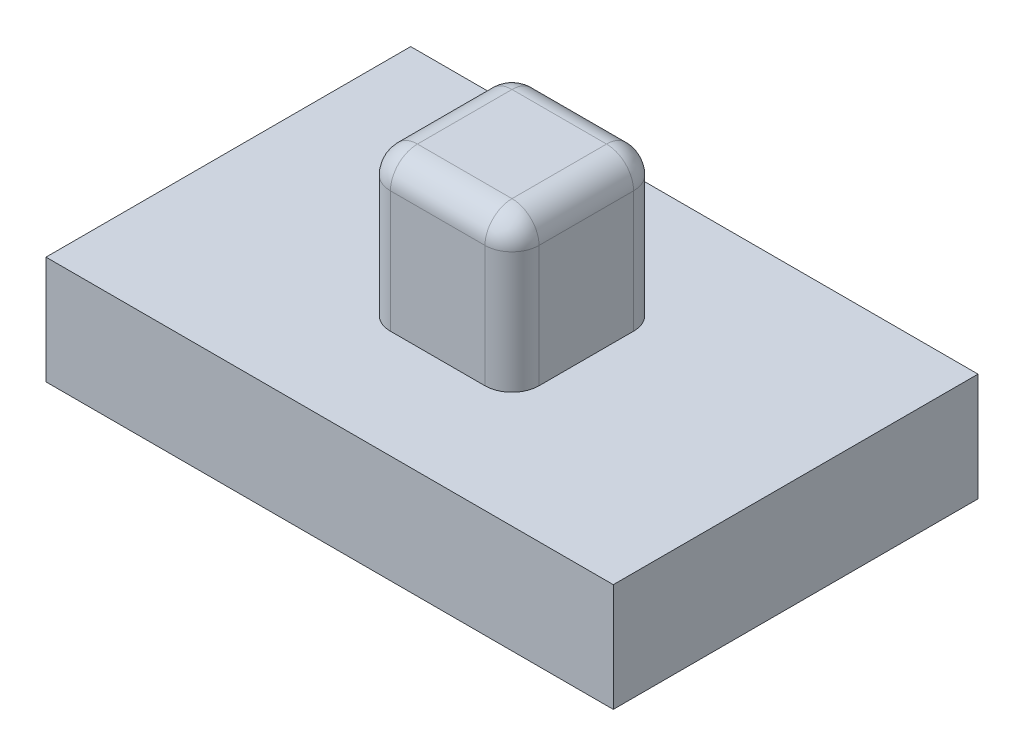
ISO-10303-21;
HEADER;
FILE_DESCRIPTION(('STEP AP214'),'2;1');
FILE_NAME('part.step','',(''),(''),'','','');
FILE_SCHEMA(('AUTOMOTIVE_DESIGN { 1 0 10303 214 1 1 1 1 }'));
ENDSEC;
DATA;
#1=APPLICATION_CONTEXT('core data for automotive mechanical design processes');
#2=APPLICATION_PROTOCOL_DEFINITION('international standard','automotive_design',2000,#1);
#3=PRODUCT_CONTEXT('',#1,'mechanical');
#4=PRODUCT('Part','Part','',(#3));
#5=PRODUCT_RELATED_PRODUCT_CATEGORY('part','',(#4));
#6=PRODUCT_DEFINITION_FORMATION('','',#4);
#7=PRODUCT_DEFINITION_CONTEXT('part definition',#1,'design');
#8=PRODUCT_DEFINITION('design','',#6,#7);
#9=PRODUCT_DEFINITION_SHAPE('','',#8);
#10=(LENGTH_UNIT() NAMED_UNIT(*) SI_UNIT(.MILLI.,.METRE.));
#11=(NAMED_UNIT(*) PLANE_ANGLE_UNIT() SI_UNIT($,.RADIAN.));
#12=(NAMED_UNIT(*) SI_UNIT($,.STERADIAN.) SOLID_ANGLE_UNIT());
#13=UNCERTAINTY_MEASURE_WITH_UNIT(LENGTH_MEASURE(1.E-05),#10,'distance_accuracy_value','');
#14=(GEOMETRIC_REPRESENTATION_CONTEXT(3) GLOBAL_UNCERTAINTY_ASSIGNED_CONTEXT((#13)) GLOBAL_UNIT_ASSIGNED_CONTEXT((#10,
#11,#12)) REPRESENTATION_CONTEXT('',''));
#15=CARTESIAN_POINT('',(0.,0.,0.));
#16=DIRECTION('',(0.,0.,1.));
#17=DIRECTION('',(1.,0.,0.));
#18=AXIS2_PLACEMENT_3D('',#15,#16,#17);
#19=CARTESIAN_POINT('',(0.,8.,0.));
#20=DIRECTION('',(0.,-1.,0.));
#21=DIRECTION('',(0.,0.,-1.));
#22=AXIS2_PLACEMENT_3D('',#19,#20,#21);
#23=PLANE('',#22);
#24=DIRECTION('',(0.,0.,-1.));
#25=VECTOR('',#24,1.);
#26=CARTESIAN_POINT('',(21.,8.,13.5));
#27=LINE('',#26,#25);
#28=CARTESIAN_POINT('',(21.,8.,13.5));
#29=VERTEX_POINT('',#28);
#30=CARTESIAN_POINT('',(21.,8.,-13.5));
#31=VERTEX_POINT('',#30);
#32=EDGE_CURVE('E147',#29,#31,#27,.T.);
#33=ORIENTED_EDGE('',*,*,#32,.T.);
#34=DIRECTION('',(-1.,0.,0.));
#35=VECTOR('',#34,1.);
#36=CARTESIAN_POINT('',(-21.,8.,-13.5));
#37=LINE('',#36,#35);
#38=CARTESIAN_POINT('',(-21.,8.,-13.5));
#39=VERTEX_POINT('',#38);
#40=EDGE_CURVE('E136',#31,#39,#37,.T.);
#41=ORIENTED_EDGE('',*,*,#40,.T.);
#42=DIRECTION('',(0.,0.,1.));
#43=VECTOR('',#42,1.);
#44=CARTESIAN_POINT('',(-21.,8.,13.5));
#45=LINE('',#44,#43);
#46=CARTESIAN_POINT('',(-21.,8.,13.5));
#47=VERTEX_POINT('',#46);
#48=EDGE_CURVE('E146',#39,#47,#45,.T.);
#49=ORIENTED_EDGE('',*,*,#48,.T.);
#50=DIRECTION('',(1.,0.,0.));
#51=VECTOR('',#50,1.);
#52=CARTESIAN_POINT('',(-21.,8.,13.5));
#53=LINE('',#52,#51);
#54=EDGE_CURVE('E152',#47,#29,#53,.T.);
#55=ORIENTED_EDGE('',*,*,#54,.T.);
#56=EDGE_LOOP('',(#33,#41,#49,#55));
#57=FACE_BOUND('',#56,.T.);
#58=DIRECTION('',(0.,0.,-1.));
#59=VECTOR('',#58,1.);
#60=CARTESIAN_POINT('',(5.5,8.,5.5));
#61=LINE('',#60,#59);
#62=CARTESIAN_POINT('',(5.5,8.,3.5));
#63=VERTEX_POINT('',#62);
#64=CARTESIAN_POINT('',(5.5,8.,-3.5));
#65=VERTEX_POINT('',#64);
#66=EDGE_CURVE('E236',#63,#65,#61,.T.);
#67=ORIENTED_EDGE('',*,*,#66,.F.);
#68=CARTESIAN_POINT('',(3.5,8.,3.5));
#69=DIRECTION('',(0.,-1.,0.));
#70=DIRECTION('',(0.,0.,-1.));
#71=AXIS2_PLACEMENT_3D('',#68,#69,#70);
#72=CIRCLE('',#71,2.);
#73=CARTESIAN_POINT('',(3.5,8.,5.5));
#74=VERTEX_POINT('',#73);
#75=EDGE_CURVE('E11',#63,#74,#72,.T.);
#76=ORIENTED_EDGE('',*,*,#75,.T.);
#77=DIRECTION('',(1.,0.,0.));
#78=VECTOR('',#77,1.);
#79=CARTESIAN_POINT('',(-5.5,8.,5.5));
#80=LINE('',#79,#78);
#81=CARTESIAN_POINT('',(-3.5,8.,5.5));
#82=VERTEX_POINT('',#81);
#83=EDGE_CURVE('E247',#82,#74,#80,.T.);
#84=ORIENTED_EDGE('',*,*,#83,.F.);
#85=CARTESIAN_POINT('',(-3.5,8.,3.5));
#86=DIRECTION('',(0.,-1.,0.));
#87=DIRECTION('',(0.,0.,-1.));
#88=AXIS2_PLACEMENT_3D('',#85,#86,#87);
#89=CIRCLE('',#88,2.);
#90=CARTESIAN_POINT('',(-5.5,8.,3.5));
#91=VERTEX_POINT('',#90);
#92=EDGE_CURVE('E43',#82,#91,#89,.T.);
#93=ORIENTED_EDGE('',*,*,#92,.T.);
#94=DIRECTION('',(0.,0.,1.));
#95=VECTOR('',#94,1.);
#96=CARTESIAN_POINT('',(-5.5,8.,5.5));
#97=LINE('',#96,#95);
#98=CARTESIAN_POINT('',(-5.5,8.,-3.5));
#99=VERTEX_POINT('',#98);
#100=EDGE_CURVE('E242',#99,#91,#97,.T.);
#101=ORIENTED_EDGE('',*,*,#100,.F.);
#102=CARTESIAN_POINT('',(-3.5,8.,-3.5));
#103=DIRECTION('',(0.,-1.,0.));
#104=DIRECTION('',(0.,0.,-1.));
#105=AXIS2_PLACEMENT_3D('',#102,#103,#104);
#106=CIRCLE('',#105,2.);
#107=CARTESIAN_POINT('',(-3.5,8.,-5.5));
#108=VERTEX_POINT('',#107);
#109=EDGE_CURVE('E200',#99,#108,#106,.T.);
#110=ORIENTED_EDGE('',*,*,#109,.T.);
#111=DIRECTION('',(-1.,0.,0.));
#112=VECTOR('',#111,1.);
#113=CARTESIAN_POINT('',(-5.5,8.,-5.5));
#114=LINE('',#113,#112);
#115=CARTESIAN_POINT('',(3.5,8.,-5.5));
#116=VERTEX_POINT('',#115);
#117=EDGE_CURVE('E238',#116,#108,#114,.T.);
#118=ORIENTED_EDGE('',*,*,#117,.F.);
#119=CARTESIAN_POINT('',(3.5,8.,-3.5));
#120=DIRECTION('',(0.,-1.,0.));
#121=DIRECTION('',(0.,0.,-1.));
#122=AXIS2_PLACEMENT_3D('',#119,#120,#121);
#123=CIRCLE('',#122,2.);
#124=EDGE_CURVE('E198',#116,#65,#123,.T.);
#125=ORIENTED_EDGE('',*,*,#124,.T.);
#126=EDGE_LOOP('',(#67,#76,#84,#93,#101,#110,#118,#125));
#127=FACE_BOUND('',#126,.T.);
#128=ADVANCED_FACE('F34',(#57,#127),#23,.F.);
#129=CARTESIAN_POINT('',(21.,8.,13.5));
#130=DIRECTION('',(-1.,0.,0.));
#131=DIRECTION('',(0.,0.,1.));
#132=AXIS2_PLACEMENT_3D('',#129,#130,#131);
#133=PLANE('',#132);
#134=DIRECTION('',(0.,0.,-1.));
#135=VECTOR('',#134,1.);
#136=CARTESIAN_POINT('',(21.,0.,13.5));
#137=LINE('',#136,#135);
#138=CARTESIAN_POINT('',(21.,0.,13.5));
#139=VERTEX_POINT('',#138);
#140=CARTESIAN_POINT('',(21.,0.,-13.5));
#141=VERTEX_POINT('',#140);
#142=EDGE_CURVE('E160',#139,#141,#137,.T.);
#143=ORIENTED_EDGE('',*,*,#142,.T.);
#144=DIRECTION('',(0.,-1.,0.));
#145=VECTOR('',#144,1.);
#146=CARTESIAN_POINT('',(21.,8.,-13.5));
#147=LINE('',#146,#145);
#148=EDGE_CURVE('E140',#31,#141,#147,.T.);
#149=ORIENTED_EDGE('',*,*,#148,.F.);
#150=ORIENTED_EDGE('',*,*,#32,.F.);
#151=DIRECTION('',(0.,-1.,0.));
#152=VECTOR('',#151,1.);
#153=CARTESIAN_POINT('',(21.,8.,13.5));
#154=LINE('',#153,#152);
#155=EDGE_CURVE('E252',#29,#139,#154,.T.);
#156=ORIENTED_EDGE('',*,*,#155,.T.);
#157=EDGE_LOOP('',(#143,#149,#150,#156));
#158=FACE_BOUND('',#157,.T.);
#159=ADVANCED_FACE('F158',(#158),#133,.F.);
#160=CARTESIAN_POINT('',(-21.,8.,-13.5));
#161=DIRECTION('',(0.,0.,1.));
#162=DIRECTION('',(1.,0.,0.));
#163=AXIS2_PLACEMENT_3D('',#160,#161,#162);
#164=PLANE('',#163);
#165=DIRECTION('',(-1.,0.,0.));
#166=VECTOR('',#165,1.);
#167=CARTESIAN_POINT('',(-21.,0.,-13.5));
#168=LINE('',#167,#166);
#169=CARTESIAN_POINT('',(-21.,0.,-13.5));
#170=VERTEX_POINT('',#169);
#171=EDGE_CURVE('E254',#141,#170,#168,.T.);
#172=ORIENTED_EDGE('',*,*,#171,.T.);
#173=DIRECTION('',(0.,-1.,0.));
#174=VECTOR('',#173,1.);
#175=CARTESIAN_POINT('',(-21.,8.,-13.5));
#176=LINE('',#175,#174);
#177=EDGE_CURVE('E143',#39,#170,#176,.T.);
#178=ORIENTED_EDGE('',*,*,#177,.F.);
#179=ORIENTED_EDGE('',*,*,#40,.F.);
#180=ORIENTED_EDGE('',*,*,#148,.T.);
#181=EDGE_LOOP('',(#172,#178,#179,#180));
#182=FACE_BOUND('',#181,.T.);
#183=ADVANCED_FACE('F138',(#182),#164,.F.);
#184=CARTESIAN_POINT('',(-21.,8.,13.5));
#185=DIRECTION('',(1.,0.,0.));
#186=DIRECTION('',(0.,0.,-1.));
#187=AXIS2_PLACEMENT_3D('',#184,#185,#186);
#188=PLANE('',#187);
#189=DIRECTION('',(0.,0.,1.));
#190=VECTOR('',#189,1.);
#191=CARTESIAN_POINT('',(-21.,0.,13.5));
#192=LINE('',#191,#190);
#193=CARTESIAN_POINT('',(-21.,0.,13.5));
#194=VERTEX_POINT('',#193);
#195=EDGE_CURVE('E256',#170,#194,#192,.T.);
#196=ORIENTED_EDGE('',*,*,#195,.T.);
#197=DIRECTION('',(0.,-1.,0.));
#198=VECTOR('',#197,1.);
#199=CARTESIAN_POINT('',(-21.,8.,13.5));
#200=LINE('',#199,#198);
#201=EDGE_CURVE('E165',#47,#194,#200,.T.);
#202=ORIENTED_EDGE('',*,*,#201,.F.);
#203=ORIENTED_EDGE('',*,*,#48,.F.);
#204=ORIENTED_EDGE('',*,*,#177,.T.);
#205=EDGE_LOOP('',(#196,#202,#203,#204));
#206=FACE_BOUND('',#205,.T.);
#207=ADVANCED_FACE('F268',(#206),#188,.F.);
#208=CARTESIAN_POINT('',(-21.,8.,13.5));
#209=DIRECTION('',(0.,0.,-1.));
#210=DIRECTION('',(-1.,0.,0.));
#211=AXIS2_PLACEMENT_3D('',#208,#209,#210);
#212=PLANE('',#211);
#213=DIRECTION('',(1.,0.,0.));
#214=VECTOR('',#213,1.);
#215=CARTESIAN_POINT('',(-21.,0.,13.5));
#216=LINE('',#215,#214);
#217=EDGE_CURVE('E156',#194,#139,#216,.T.);
#218=ORIENTED_EDGE('',*,*,#217,.T.);
#219=ORIENTED_EDGE('',*,*,#155,.F.);
#220=ORIENTED_EDGE('',*,*,#54,.F.);
#221=ORIENTED_EDGE('',*,*,#201,.T.);
#222=EDGE_LOOP('',(#218,#219,#220,#221));
#223=FACE_BOUND('',#222,.T.);
#224=ADVANCED_FACE('F263',(#223),#212,.F.);
#225=CARTESIAN_POINT('',(0.,0.,0.));
#226=DIRECTION('',(0.,-1.,0.));
#227=DIRECTION('',(0.,0.,-1.));
#228=AXIS2_PLACEMENT_3D('',#225,#226,#227);
#229=PLANE('',#228);
#230=ORIENTED_EDGE('',*,*,#142,.F.);
#231=ORIENTED_EDGE('',*,*,#217,.F.);
#232=ORIENTED_EDGE('',*,*,#195,.F.);
#233=ORIENTED_EDGE('',*,*,#171,.F.);
#234=EDGE_LOOP('',(#230,#231,#232,#233));
#235=FACE_BOUND('',#234,.T.);
#236=ADVANCED_FACE('F267',(#235),#229,.T.);
#237=CARTESIAN_POINT('',(5.5,19.,5.5));
#238=DIRECTION('',(-1.,0.,0.));
#239=DIRECTION('',(0.,0.,1.));
#240=AXIS2_PLACEMENT_3D('',#237,#238,#239);
#241=PLANE('',#240);
#242=ORIENTED_EDGE('',*,*,#66,.T.);
#243=DIRECTION('',(0.,-1.,0.));
#244=VECTOR('',#243,1.);
#245=CARTESIAN_POINT('',(5.5,19.,-3.5));
#246=LINE('',#245,#244);
#247=CARTESIAN_POINT('',(5.5,17.,-3.5));
#248=VERTEX_POINT('',#247);
#249=EDGE_CURVE('E51',#65,#248,#246,.F.);
#250=ORIENTED_EDGE('',*,*,#249,.T.);
#251=DIRECTION('',(0.,0.,-1.));
#252=VECTOR('',#251,1.);
#253=CARTESIAN_POINT('',(5.5,17.,5.5));
#254=LINE('',#253,#252);
#255=CARTESIAN_POINT('',(5.5,17.,3.5));
#256=VERTEX_POINT('',#255);
#257=EDGE_CURVE('E56',#248,#256,#254,.F.);
#258=ORIENTED_EDGE('',*,*,#257,.T.);
#259=DIRECTION('',(0.,-1.,0.));
#260=VECTOR('',#259,1.);
#261=CARTESIAN_POINT('',(5.5,19.,3.5));
#262=LINE('',#261,#260);
#263=EDGE_CURVE('E194',#256,#63,#262,.T.);
#264=ORIENTED_EDGE('',*,*,#263,.T.);
#265=EDGE_LOOP('',(#242,#250,#258,#264));
#266=FACE_BOUND('',#265,.T.);
#267=ADVANCED_FACE('F285',(#266),#241,.F.);
#268=CARTESIAN_POINT('',(-5.5,19.,-5.5));
#269=DIRECTION('',(0.,0.,1.));
#270=DIRECTION('',(1.,0.,0.));
#271=AXIS2_PLACEMENT_3D('',#268,#269,#270);
#272=PLANE('',#271);
#273=DIRECTION('',(-1.,0.,0.));
#274=VECTOR('',#273,1.);
#275=CARTESIAN_POINT('',(-5.5,17.,-5.5));
#276=LINE('',#275,#274);
#277=CARTESIAN_POINT('',(-3.5,17.,-5.5));
#278=VERTEX_POINT('',#277);
#279=CARTESIAN_POINT('',(3.5,17.,-5.5));
#280=VERTEX_POINT('',#279);
#281=EDGE_CURVE('E190',#278,#280,#276,.F.);
#282=ORIENTED_EDGE('',*,*,#281,.T.);
#283=DIRECTION('',(0.,-1.,0.));
#284=VECTOR('',#283,1.);
#285=CARTESIAN_POINT('',(3.5,19.,-5.5));
#286=LINE('',#285,#284);
#287=EDGE_CURVE('E192',#280,#116,#286,.T.);
#288=ORIENTED_EDGE('',*,*,#287,.T.);
#289=ORIENTED_EDGE('',*,*,#117,.T.);
#290=DIRECTION('',(0.,-1.,0.));
#291=VECTOR('',#290,1.);
#292=CARTESIAN_POINT('',(-3.5,19.,-5.5));
#293=LINE('',#292,#291);
#294=EDGE_CURVE('E188',#108,#278,#293,.F.);
#295=ORIENTED_EDGE('',*,*,#294,.T.);
#296=EDGE_LOOP('',(#282,#288,#289,#295));
#297=FACE_BOUND('',#296,.T.);
#298=ADVANCED_FACE('F291',(#297),#272,.F.);
#299=CARTESIAN_POINT('',(-5.5,19.,5.5));
#300=DIRECTION('',(1.,0.,0.));
#301=DIRECTION('',(0.,0.,-1.));
#302=AXIS2_PLACEMENT_3D('',#299,#300,#301);
#303=PLANE('',#302);
#304=DIRECTION('',(0.,0.,1.));
#305=VECTOR('',#304,1.);
#306=CARTESIAN_POINT('',(-5.5,17.,5.5));
#307=LINE('',#306,#305);
#308=CARTESIAN_POINT('',(-5.5,17.,3.5));
#309=VERTEX_POINT('',#308);
#310=CARTESIAN_POINT('',(-5.5,17.,-3.5));
#311=VERTEX_POINT('',#310);
#312=EDGE_CURVE('E184',#309,#311,#307,.F.);
#313=ORIENTED_EDGE('',*,*,#312,.T.);
#314=DIRECTION('',(0.,-1.,0.));
#315=VECTOR('',#314,1.);
#316=CARTESIAN_POINT('',(-5.5,19.,-3.5));
#317=LINE('',#316,#315);
#318=EDGE_CURVE('E186',#311,#99,#317,.T.);
#319=ORIENTED_EDGE('',*,*,#318,.T.);
#320=ORIENTED_EDGE('',*,*,#100,.T.);
#321=DIRECTION('',(0.,-1.,0.));
#322=VECTOR('',#321,1.);
#323=CARTESIAN_POINT('',(-5.5,19.,3.5));
#324=LINE('',#323,#322);
#325=EDGE_CURVE('E182',#91,#309,#324,.F.);
#326=ORIENTED_EDGE('',*,*,#325,.T.);
#327=EDGE_LOOP('',(#313,#319,#320,#326));
#328=FACE_BOUND('',#327,.T.);
#329=ADVANCED_FACE('F295',(#328),#303,.F.);
#330=CARTESIAN_POINT('',(-5.5,19.,5.5));
#331=DIRECTION('',(0.,0.,-1.));
#332=DIRECTION('',(-1.,0.,0.));
#333=AXIS2_PLACEMENT_3D('',#330,#331,#332);
#334=PLANE('',#333);
#335=DIRECTION('',(1.,0.,0.));
#336=VECTOR('',#335,1.);
#337=CARTESIAN_POINT('',(-5.5,17.,5.5));
#338=LINE('',#337,#336);
#339=CARTESIAN_POINT('',(3.5,17.,5.5));
#340=VERTEX_POINT('',#339);
#341=CARTESIAN_POINT('',(-3.5,17.,5.5));
#342=VERTEX_POINT('',#341);
#343=EDGE_CURVE('E177',#340,#342,#338,.F.);
#344=ORIENTED_EDGE('',*,*,#343,.T.);
#345=DIRECTION('',(0.,-1.,0.));
#346=VECTOR('',#345,1.);
#347=CARTESIAN_POINT('',(-3.5,19.,5.5));
#348=LINE('',#347,#346);
#349=EDGE_CURVE('E180',#342,#82,#348,.T.);
#350=ORIENTED_EDGE('',*,*,#349,.T.);
#351=ORIENTED_EDGE('',*,*,#83,.T.);
#352=DIRECTION('',(0.,-1.,0.));
#353=VECTOR('',#352,1.);
#354=CARTESIAN_POINT('',(3.5,19.,5.5));
#355=LINE('',#354,#353);
#356=EDGE_CURVE('E175',#74,#340,#355,.F.);
#357=ORIENTED_EDGE('',*,*,#356,.T.);
#358=EDGE_LOOP('',(#344,#350,#351,#357));
#359=FACE_BOUND('',#358,.T.);
#360=ADVANCED_FACE('F300',(#359),#334,.F.);
#361=CARTESIAN_POINT('',(0.,19.,0.));
#362=DIRECTION('',(0.,-1.,0.));
#363=DIRECTION('',(0.,0.,-1.));
#364=AXIS2_PLACEMENT_3D('',#361,#362,#363);
#365=PLANE('',#364);
#366=DIRECTION('',(0.,0.,1.));
#367=VECTOR('',#366,1.);
#368=CARTESIAN_POINT('',(-3.5,19.,0.));
#369=LINE('',#368,#367);
#370=CARTESIAN_POINT('',(-3.5,19.,-3.5));
#371=VERTEX_POINT('',#370);
#372=CARTESIAN_POINT('',(-3.5,19.,3.5));
#373=VERTEX_POINT('',#372);
#374=EDGE_CURVE('E170',#371,#373,#369,.T.);
#375=ORIENTED_EDGE('',*,*,#374,.T.);
#376=DIRECTION('',(1.,0.,0.));
#377=VECTOR('',#376,1.);
#378=CARTESIAN_POINT('',(0.,19.,3.5));
#379=LINE('',#378,#377);
#380=CARTESIAN_POINT('',(3.5,19.,3.5));
#381=VERTEX_POINT('',#380);
#382=EDGE_CURVE('E172',#373,#381,#379,.T.);
#383=ORIENTED_EDGE('',*,*,#382,.T.);
#384=DIRECTION('',(0.,0.,-1.));
#385=VECTOR('',#384,1.);
#386=CARTESIAN_POINT('',(3.5,19.,0.));
#387=LINE('',#386,#385);
#388=CARTESIAN_POINT('',(3.5,19.,-3.5));
#389=VERTEX_POINT('',#388);
#390=EDGE_CURVE('E161',#381,#389,#387,.T.);
#391=ORIENTED_EDGE('',*,*,#390,.T.);
#392=DIRECTION('',(-1.,0.,0.));
#393=VECTOR('',#392,1.);
#394=CARTESIAN_POINT('',(0.,19.,-3.5));
#395=LINE('',#394,#393);
#396=EDGE_CURVE('E163',#389,#371,#395,.T.);
#397=ORIENTED_EDGE('',*,*,#396,.T.);
#398=EDGE_LOOP('',(#375,#383,#391,#397));
#399=FACE_BOUND('',#398,.T.);
#400=ADVANCED_FACE('F306',(#399),#365,.F.);
#401=CARTESIAN_POINT('',(-3.5,19.,-3.5));
#402=DIRECTION('',(0.,-1.,0.));
#403=DIRECTION('',(0.,0.,-1.));
#404=AXIS2_PLACEMENT_3D('',#401,#402,#403);
#405=CYLINDRICAL_SURFACE('',#404,2.);
#406=ORIENTED_EDGE('',*,*,#109,.F.);
#407=ORIENTED_EDGE('',*,*,#318,.F.);
#408=CARTESIAN_POINT('',(-3.5,17.,-3.5));
#409=DIRECTION('',(0.,1.,0.));
#410=DIRECTION('',(0.,0.,1.));
#411=AXIS2_PLACEMENT_3D('',#408,#409,#410);
#412=CIRCLE('',#411,2.);
#413=EDGE_CURVE('E38',#278,#311,#412,.T.);
#414=ORIENTED_EDGE('',*,*,#413,.F.);
#415=ORIENTED_EDGE('',*,*,#294,.F.);
#416=EDGE_LOOP('',(#406,#407,#414,#415));
#417=FACE_BOUND('',#416,.T.);
#418=ADVANCED_FACE('F36',(#417),#405,.T.);
#419=CARTESIAN_POINT('',(0.,17.,-3.5));
#420=DIRECTION('',(-1.,0.,0.));
#421=DIRECTION('',(0.,0.,1.));
#422=AXIS2_PLACEMENT_3D('',#419,#420,#421);
#423=CYLINDRICAL_SURFACE('',#422,2.);
#424=CARTESIAN_POINT('',(3.5,17.,-3.5));
#425=DIRECTION('',(1.,0.,0.));
#426=DIRECTION('',(0.,0.,-1.));
#427=AXIS2_PLACEMENT_3D('',#424,#425,#426);
#428=CIRCLE('',#427,2.);
#429=EDGE_CURVE('E228',#280,#389,#428,.T.);
#430=ORIENTED_EDGE('',*,*,#429,.F.);
#431=ORIENTED_EDGE('',*,*,#281,.F.);
#432=CARTESIAN_POINT('',(-3.5,17.,-3.5));
#433=DIRECTION('',(-1.,0.,0.));
#434=DIRECTION('',(0.,0.,1.));
#435=AXIS2_PLACEMENT_3D('',#432,#433,#434);
#436=CIRCLE('',#435,2.);
#437=EDGE_CURVE('E230',#371,#278,#436,.T.);
#438=ORIENTED_EDGE('',*,*,#437,.F.);
#439=ORIENTED_EDGE('',*,*,#396,.F.);
#440=EDGE_LOOP('',(#430,#431,#438,#439));
#441=FACE_BOUND('',#440,.T.);
#442=ADVANCED_FACE('F313',(#441),#423,.T.);
#443=CARTESIAN_POINT('',(3.5,19.,-3.5));
#444=DIRECTION('',(0.,-1.,0.));
#445=DIRECTION('',(0.,0.,-1.));
#446=AXIS2_PLACEMENT_3D('',#443,#444,#445);
#447=CYLINDRICAL_SURFACE('',#446,2.);
#448=ORIENTED_EDGE('',*,*,#124,.F.);
#449=ORIENTED_EDGE('',*,*,#287,.F.);
#450=CARTESIAN_POINT('',(3.5,17.,-3.5));
#451=DIRECTION('',(0.,1.,0.));
#452=DIRECTION('',(0.,0.,1.));
#453=AXIS2_PLACEMENT_3D('',#450,#451,#452);
#454=CIRCLE('',#453,2.);
#455=EDGE_CURVE('E225',#248,#280,#454,.T.);
#456=ORIENTED_EDGE('',*,*,#455,.F.);
#457=ORIENTED_EDGE('',*,*,#249,.F.);
#458=EDGE_LOOP('',(#448,#449,#456,#457));
#459=FACE_BOUND('',#458,.T.);
#460=ADVANCED_FACE('F347',(#459),#447,.T.);
#461=CARTESIAN_POINT('',(-3.5,17.,-3.5));
#462=DIRECTION('',(0.,0.,1.));
#463=DIRECTION('',(1.,0.,0.));
#464=AXIS2_PLACEMENT_3D('',#461,#462,#463);
#465=SPHERICAL_SURFACE('',#464,2.);
#466=ORIENTED_EDGE('',*,*,#437,.T.);
#467=ORIENTED_EDGE('',*,*,#413,.T.);
#468=CARTESIAN_POINT('',(-3.5,17.,-3.5));
#469=DIRECTION('',(0.,0.,-1.));
#470=DIRECTION('',(0.,1.,0.));
#471=AXIS2_PLACEMENT_3D('',#468,#469,#470);
#472=CIRCLE('',#471,2.);
#473=EDGE_CURVE('E222',#371,#311,#472,.F.);
#474=ORIENTED_EDGE('',*,*,#473,.F.);
#475=EDGE_LOOP('',(#466,#467,#474));
#476=FACE_BOUND('',#475,.T.);
#477=ADVANCED_FACE('F378',(#476),#465,.T.);
#478=CARTESIAN_POINT('',(3.5,17.,-3.5));
#479=DIRECTION('',(0.,0.,1.));
#480=DIRECTION('',(1.,0.,0.));
#481=AXIS2_PLACEMENT_3D('',#478,#479,#480);
#482=SPHERICAL_SURFACE('',#481,2.);
#483=ORIENTED_EDGE('',*,*,#455,.T.);
#484=ORIENTED_EDGE('',*,*,#429,.T.);
#485=CARTESIAN_POINT('',(3.5,17.,-3.5));
#486=DIRECTION('',(0.,0.,-1.));
#487=DIRECTION('',(-1.,0.,0.));
#488=AXIS2_PLACEMENT_3D('',#485,#486,#487);
#489=CIRCLE('',#488,2.);
#490=EDGE_CURVE('E219',#248,#389,#489,.F.);
#491=ORIENTED_EDGE('',*,*,#490,.F.);
#492=EDGE_LOOP('',(#483,#484,#491));
#493=FACE_BOUND('',#492,.T.);
#494=ADVANCED_FACE('F343',(#493),#482,.T.);
#495=CARTESIAN_POINT('',(-3.5,19.,3.5));
#496=DIRECTION('',(0.,-1.,0.));
#497=DIRECTION('',(0.,0.,-1.));
#498=AXIS2_PLACEMENT_3D('',#495,#496,#497);
#499=CYLINDRICAL_SURFACE('',#498,2.);
#500=ORIENTED_EDGE('',*,*,#92,.F.);
#501=ORIENTED_EDGE('',*,*,#349,.F.);
#502=CARTESIAN_POINT('',(-3.5,17.,3.5));
#503=DIRECTION('',(0.,1.,0.));
#504=DIRECTION('',(0.,0.,1.));
#505=AXIS2_PLACEMENT_3D('',#502,#503,#504);
#506=CIRCLE('',#505,2.);
#507=EDGE_CURVE('E216',#309,#342,#506,.T.);
#508=ORIENTED_EDGE('',*,*,#507,.F.);
#509=ORIENTED_EDGE('',*,*,#325,.F.);
#510=EDGE_LOOP('',(#500,#501,#508,#509));
#511=FACE_BOUND('',#510,.T.);
#512=ADVANCED_FACE('F356',(#511),#499,.T.);
#513=CARTESIAN_POINT('',(-3.5,17.,0.));
#514=DIRECTION('',(0.,0.,1.));
#515=DIRECTION('',(1.,0.,0.));
#516=AXIS2_PLACEMENT_3D('',#513,#514,#515);
#517=CYLINDRICAL_SURFACE('',#516,2.);
#518=ORIENTED_EDGE('',*,*,#473,.T.);
#519=ORIENTED_EDGE('',*,*,#312,.F.);
#520=CARTESIAN_POINT('',(-3.5,17.,3.5));
#521=DIRECTION('',(0.,0.,1.));
#522=DIRECTION('',(1.,0.,0.));
#523=AXIS2_PLACEMENT_3D('',#520,#521,#522);
#524=CIRCLE('',#523,2.);
#525=EDGE_CURVE('E213',#373,#309,#524,.T.);
#526=ORIENTED_EDGE('',*,*,#525,.F.);
#527=ORIENTED_EDGE('',*,*,#374,.F.);
#528=EDGE_LOOP('',(#518,#519,#526,#527));
#529=FACE_BOUND('',#528,.T.);
#530=ADVANCED_FACE('F322',(#529),#517,.T.);
#531=CARTESIAN_POINT('',(3.5,17.,0.));
#532=DIRECTION('',(0.,0.,-1.));
#533=DIRECTION('',(-1.,0.,0.));
#534=AXIS2_PLACEMENT_3D('',#531,#532,#533);
#535=CYLINDRICAL_SURFACE('',#534,2.);
#536=ORIENTED_EDGE('',*,*,#490,.T.);
#537=ORIENTED_EDGE('',*,*,#390,.F.);
#538=CARTESIAN_POINT('',(3.5,17.,3.5));
#539=DIRECTION('',(0.,0.,1.));
#540=DIRECTION('',(1.,0.,0.));
#541=AXIS2_PLACEMENT_3D('',#538,#539,#540);
#542=CIRCLE('',#541,2.);
#543=EDGE_CURVE('E210',#256,#381,#542,.T.);
#544=ORIENTED_EDGE('',*,*,#543,.F.);
#545=ORIENTED_EDGE('',*,*,#257,.F.);
#546=EDGE_LOOP('',(#536,#537,#544,#545));
#547=FACE_BOUND('',#546,.T.);
#548=ADVANCED_FACE('F337',(#547),#535,.T.);
#549=CARTESIAN_POINT('',(3.5,19.,3.5));
#550=DIRECTION('',(0.,-1.,0.));
#551=DIRECTION('',(0.,0.,-1.));
#552=AXIS2_PLACEMENT_3D('',#549,#550,#551);
#553=CYLINDRICAL_SURFACE('',#552,2.);
#554=ORIENTED_EDGE('',*,*,#75,.F.);
#555=ORIENTED_EDGE('',*,*,#263,.F.);
#556=CARTESIAN_POINT('',(3.5,17.,3.5));
#557=DIRECTION('',(0.,1.,0.));
#558=DIRECTION('',(0.,0.,1.));
#559=AXIS2_PLACEMENT_3D('',#556,#557,#558);
#560=CIRCLE('',#559,2.);
#561=EDGE_CURVE('E207',#340,#256,#560,.T.);
#562=ORIENTED_EDGE('',*,*,#561,.F.);
#563=ORIENTED_EDGE('',*,*,#356,.F.);
#564=EDGE_LOOP('',(#554,#555,#562,#563));
#565=FACE_BOUND('',#564,.T.);
#566=ADVANCED_FACE('F361',(#565),#553,.T.);
#567=CARTESIAN_POINT('',(-3.5,17.,3.5));
#568=DIRECTION('',(0.,0.,1.));
#569=DIRECTION('',(1.,0.,0.));
#570=AXIS2_PLACEMENT_3D('',#567,#568,#569);
#571=SPHERICAL_SURFACE('',#570,2.);
#572=ORIENTED_EDGE('',*,*,#525,.T.);
#573=ORIENTED_EDGE('',*,*,#507,.T.);
#574=CARTESIAN_POINT('',(-3.5,17.,3.5));
#575=DIRECTION('',(-1.,0.,0.));
#576=DIRECTION('',(0.,0.,1.));
#577=AXIS2_PLACEMENT_3D('',#574,#575,#576);
#578=CIRCLE('',#577,2.);
#579=EDGE_CURVE('E205',#373,#342,#578,.F.);
#580=ORIENTED_EDGE('',*,*,#579,.F.);
#581=EDGE_LOOP('',(#572,#573,#580));
#582=FACE_BOUND('',#581,.T.);
#583=ADVANCED_FACE('F325',(#582),#571,.T.);
#584=CARTESIAN_POINT('',(3.5,17.,3.5));
#585=DIRECTION('',(0.,0.,1.));
#586=DIRECTION('',(1.,0.,0.));
#587=AXIS2_PLACEMENT_3D('',#584,#585,#586);
#588=SPHERICAL_SURFACE('',#587,2.);
#589=ORIENTED_EDGE('',*,*,#561,.T.);
#590=ORIENTED_EDGE('',*,*,#543,.T.);
#591=CARTESIAN_POINT('',(3.5,17.,3.5));
#592=DIRECTION('',(1.,0.,0.));
#593=DIRECTION('',(0.,0.,-1.));
#594=AXIS2_PLACEMENT_3D('',#591,#592,#593);
#595=CIRCLE('',#594,2.);
#596=EDGE_CURVE('E203',#340,#381,#595,.F.);
#597=ORIENTED_EDGE('',*,*,#596,.F.);
#598=EDGE_LOOP('',(#589,#590,#597));
#599=FACE_BOUND('',#598,.T.);
#600=ADVANCED_FACE('F334',(#599),#588,.T.);
#601=CARTESIAN_POINT('',(0.,17.,3.5));
#602=DIRECTION('',(1.,0.,0.));
#603=DIRECTION('',(0.,0.,-1.));
#604=AXIS2_PLACEMENT_3D('',#601,#602,#603);
#605=CYLINDRICAL_SURFACE('',#604,2.);
#606=ORIENTED_EDGE('',*,*,#579,.T.);
#607=ORIENTED_EDGE('',*,*,#343,.F.);
#608=ORIENTED_EDGE('',*,*,#596,.T.);
#609=ORIENTED_EDGE('',*,*,#382,.F.);
#610=EDGE_LOOP('',(#606,#607,#608,#609));
#611=FACE_BOUND('',#610,.T.);
#612=ADVANCED_FACE('F329',(#611),#605,.T.);
#613=CLOSED_SHELL('',(#128,#159,#183,#207,#224,#236,#267,#298,#329,#360,#400,#418,#442,#460,
#477,#494,#512,#530,#548,#566,#583,#600,#612));
#614=MANIFOLD_SOLID_BREP('B2',#613);
#615=ADVANCED_BREP_SHAPE_REPRESENTATION('',(#18,#614),#14);
#616=SHAPE_DEFINITION_REPRESENTATION(#9,#615);
ENDSEC;
END-ISO-10303-21;
